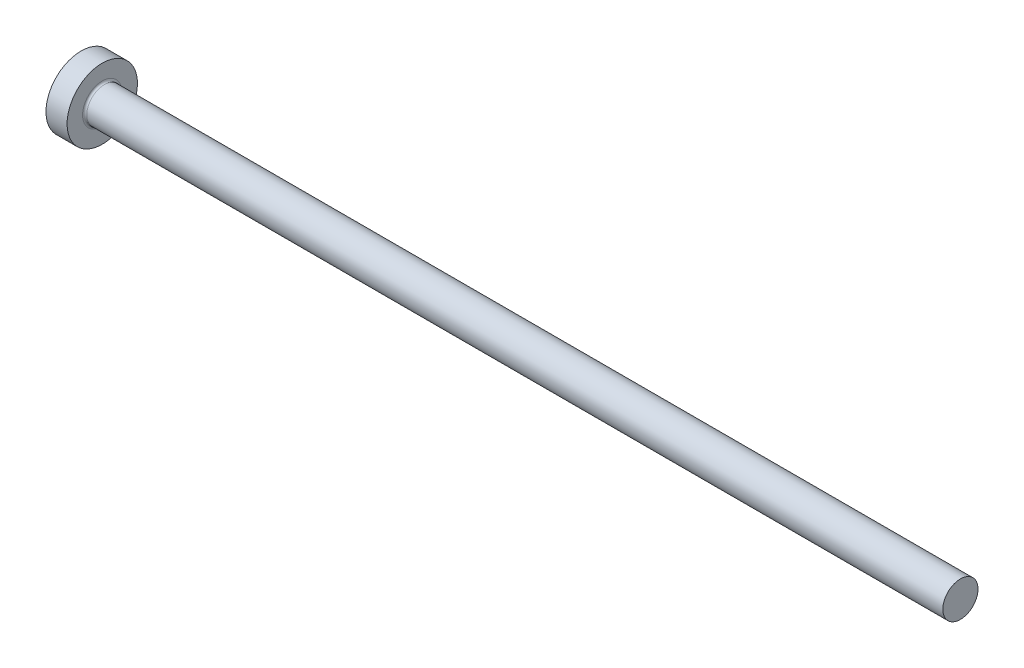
ISO-10303-21;
HEADER;
FILE_DESCRIPTION(('STEP AP214'),'2;1');
FILE_NAME('part.step','',(''),(''),'','','');
FILE_SCHEMA(('AUTOMOTIVE_DESIGN { 1 0 10303 214 1 1 1 1 }'));
ENDSEC;
DATA;
#1=APPLICATION_CONTEXT('core data for automotive mechanical design processes');
#2=APPLICATION_PROTOCOL_DEFINITION('international standard','automotive_design',2000,#1);
#3=PRODUCT_CONTEXT('',#1,'mechanical');
#4=PRODUCT('Part','Part','',(#3));
#5=PRODUCT_RELATED_PRODUCT_CATEGORY('part','',(#4));
#6=PRODUCT_DEFINITION_FORMATION('','',#4);
#7=PRODUCT_DEFINITION_CONTEXT('part definition',#1,'design');
#8=PRODUCT_DEFINITION('design','',#6,#7);
#9=PRODUCT_DEFINITION_SHAPE('','',#8);
#10=(LENGTH_UNIT() NAMED_UNIT(*) SI_UNIT(.MILLI.,.METRE.));
#11=(NAMED_UNIT(*) PLANE_ANGLE_UNIT() SI_UNIT($,.RADIAN.));
#12=(NAMED_UNIT(*) SI_UNIT($,.STERADIAN.) SOLID_ANGLE_UNIT());
#13=UNCERTAINTY_MEASURE_WITH_UNIT(LENGTH_MEASURE(1.E-05),#10,'distance_accuracy_value','');
#14=(GEOMETRIC_REPRESENTATION_CONTEXT(3) GLOBAL_UNCERTAINTY_ASSIGNED_CONTEXT((#13)) GLOBAL_UNIT_ASSIGNED_CONTEXT((#10,
#11,#12)) REPRESENTATION_CONTEXT('',''));
#15=CARTESIAN_POINT('',(0.,0.,0.));
#16=DIRECTION('',(0.,0.,1.));
#17=DIRECTION('',(1.,0.,0.));
#18=AXIS2_PLACEMENT_3D('',#15,#16,#17);
#19=CARTESIAN_POINT('',(0.,0.,0.));
#20=DIRECTION('',(-1.,0.,0.));
#21=DIRECTION('',(0.,-1.,0.));
#22=AXIS2_PLACEMENT_3D('',#19,#20,#21);
#23=PLANE('',#22);
#24=CARTESIAN_POINT('',(0.,0.,0.));
#25=DIRECTION('',(1.,0.,0.));
#26=DIRECTION('',(0.,1.,0.));
#27=AXIS2_PLACEMENT_3D('',#24,#25,#26);
#28=CIRCLE('',#27,5.);
#29=CARTESIAN_POINT('',(0.,5.,0.));
#30=VERTEX_POINT('',#29);
#31=EDGE_CURVE('E25',#30,#30,#28,.T.);
#32=ORIENTED_EDGE('',*,*,#31,.F.);
#33=EDGE_LOOP('',(#32));
#34=FACE_BOUND('',#33,.T.);
#35=ADVANCED_FACE('F14',(#34),#23,.T.);
#36=CARTESIAN_POINT('',(125.,0.,0.));
#37=DIRECTION('',(1.,0.,0.));
#38=DIRECTION('',(0.,1.,0.));
#39=AXIS2_PLACEMENT_3D('',#36,#37,#38);
#40=CYLINDRICAL_SURFACE('',#39,5.);
#41=ORIENTED_EDGE('',*,*,#31,.T.);
#42=EDGE_LOOP('',(#41));
#43=FACE_BOUND('',#42,.T.);
#44=CARTESIAN_POINT('',(3.,0.,0.));
#45=DIRECTION('',(1.,0.,0.));
#46=DIRECTION('',(0.,1.,0.));
#47=AXIS2_PLACEMENT_3D('',#44,#45,#46);
#48=CIRCLE('',#47,5.);
#49=CARTESIAN_POINT('',(3.,5.,0.));
#50=VERTEX_POINT('',#49);
#51=EDGE_CURVE('E29',#50,#50,#48,.T.);
#52=ORIENTED_EDGE('',*,*,#51,.F.);
#53=EDGE_LOOP('',(#52));
#54=FACE_BOUND('',#53,.T.);
#55=ADVANCED_FACE('F51',(#43,#54),#40,.T.);
#56=CARTESIAN_POINT('',(3.,5.,0.));
#57=DIRECTION('',(1.,0.,0.));
#58=DIRECTION('',(0.,1.,0.));
#59=AXIS2_PLACEMENT_3D('',#56,#57,#58);
#60=PLANE('',#59);
#61=CARTESIAN_POINT('',(3.,0.,0.));
#62=DIRECTION('',(1.,0.,0.));
#63=DIRECTION('',(0.,1.,0.));
#64=AXIS2_PLACEMENT_3D('',#61,#62,#63);
#65=CIRCLE('',#64,2.79999999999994);
#66=CARTESIAN_POINT('',(3.,2.79999999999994,0.));
#67=VERTEX_POINT('',#66);
#68=EDGE_CURVE('E9',#67,#67,#65,.F.);
#69=ORIENTED_EDGE('',*,*,#68,.T.);
#70=EDGE_LOOP('',(#69));
#71=FACE_BOUND('',#70,.T.);
#72=ORIENTED_EDGE('',*,*,#51,.T.);
#73=EDGE_LOOP('',(#72));
#74=FACE_BOUND('',#73,.T.);
#75=ADVANCED_FACE('F42',(#71,#74),#60,.T.);
#76=CARTESIAN_POINT('',(125.,0.,0.));
#77=DIRECTION('',(1.,0.,0.));
#78=DIRECTION('',(0.,1.,0.));
#79=AXIS2_PLACEMENT_3D('',#76,#77,#78);
#80=CYLINDRICAL_SURFACE('',#79,2.49999999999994);
#81=CARTESIAN_POINT('',(3.3,0.,0.));
#82=DIRECTION('',(1.,0.,0.));
#83=DIRECTION('',(0.,1.,0.));
#84=AXIS2_PLACEMENT_3D('',#81,#82,#83);
#85=CIRCLE('',#84,2.49999999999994);
#86=CARTESIAN_POINT('',(3.3,2.49999999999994,0.));
#87=VERTEX_POINT('',#86);
#88=EDGE_CURVE('E21',#87,#87,#85,.T.);
#89=ORIENTED_EDGE('',*,*,#88,.T.);
#90=EDGE_LOOP('',(#89));
#91=FACE_BOUND('',#90,.T.);
#92=CARTESIAN_POINT('',(125.,0.,0.));
#93=DIRECTION('',(1.,0.,0.));
#94=DIRECTION('',(0.,1.,0.));
#95=AXIS2_PLACEMENT_3D('',#92,#93,#94);
#96=CIRCLE('',#95,2.5);
#97=CARTESIAN_POINT('',(125.,2.5,0.));
#98=VERTEX_POINT('',#97);
#99=EDGE_CURVE('E34',#98,#98,#96,.T.);
#100=ORIENTED_EDGE('',*,*,#99,.F.);
#101=EDGE_LOOP('',(#100));
#102=FACE_BOUND('',#101,.T.);
#103=ADVANCED_FACE('F40',(#91,#102),#80,.T.);
#104=CARTESIAN_POINT('',(125.,2.5,0.));
#105=DIRECTION('',(1.,0.,0.));
#106=DIRECTION('',(0.,1.,0.));
#107=AXIS2_PLACEMENT_3D('',#104,#105,#106);
#108=PLANE('',#107);
#109=ORIENTED_EDGE('',*,*,#99,.T.);
#110=EDGE_LOOP('',(#109));
#111=FACE_BOUND('',#110,.T.);
#112=ADVANCED_FACE('F38',(#111),#108,.T.);
#113=CARTESIAN_POINT('',(3.3,0.,0.));
#114=DIRECTION('',(1.,0.,0.));
#115=DIRECTION('',(0.,1.,0.));
#116=AXIS2_PLACEMENT_3D('',#113,#114,#115);
#117=TOROIDAL_SURFACE('',#116,2.79999999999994,0.3);
#118=ORIENTED_EDGE('',*,*,#68,.F.);
#119=EDGE_LOOP('',(#118));
#120=FACE_BOUND('',#119,.T.);
#121=ORIENTED_EDGE('',*,*,#88,.F.);
#122=EDGE_LOOP('',(#121));
#123=FACE_BOUND('',#122,.T.);
#124=ADVANCED_FACE('F16',(#120,#123),#117,.F.);
#125=CLOSED_SHELL('',(#35,#55,#75,#103,#112,#124));
#126=MANIFOLD_SOLID_BREP('B1',#125);
#127=ADVANCED_BREP_SHAPE_REPRESENTATION('',(#18,#126),#14);
#128=SHAPE_DEFINITION_REPRESENTATION(#9,#127);
ENDSEC;
END-ISO-10303-21;
